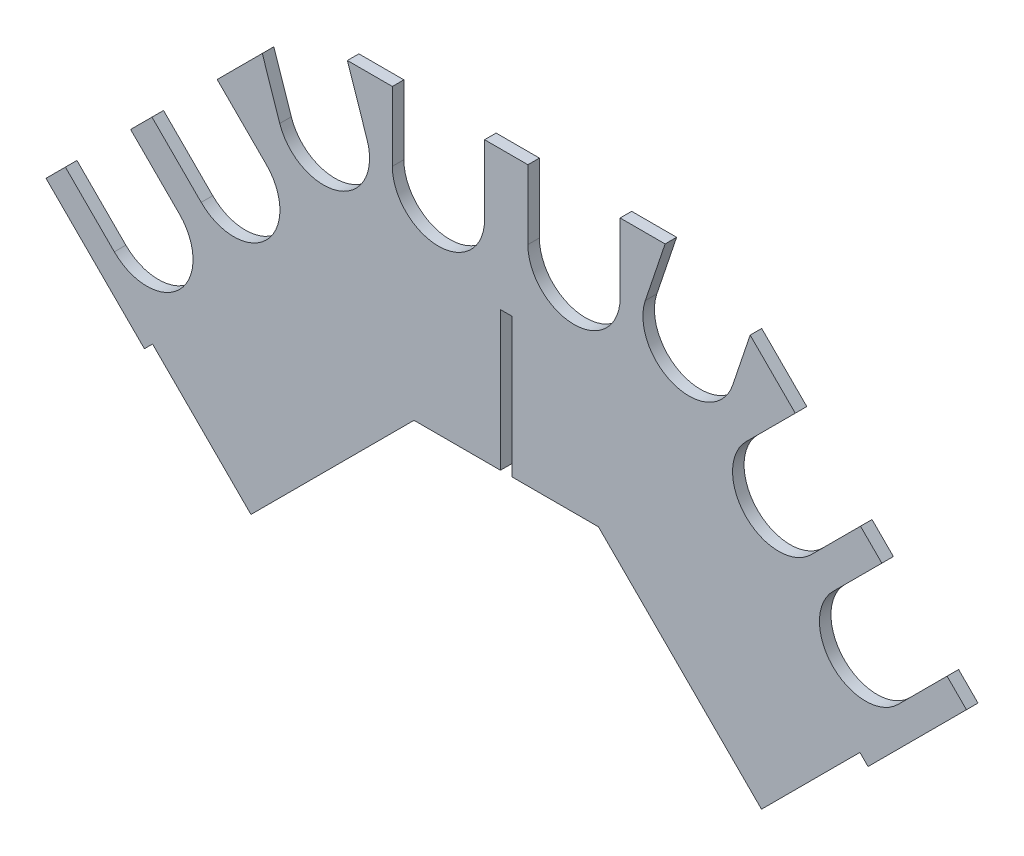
from build123d import *

# Parameters (mm, degrees)
SKETCH1_R          = 50.8
EXTRUDE1_DEPTH     = 12.7
CUT_EXTRUDE1_REACH = 936.887


with BuildPart() as part:
    # Sketch1 → Extrude1 (new body)
    with BuildSketch(Plane.XY):
        Polygon((506.987939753, 506.987939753), (228.6, 785.375879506), (-228.6, 785.375879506), (-506.987939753, 506.987939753), (-398.586659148, 398.586659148), (-389.606403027, 407.566915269), (-281.205122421, 299.165634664), (-101.6, 478.770757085), (-6.35, 478.770757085), (-6.35, 632.073318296), (6.35, 632.073318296), (6.35, 478.770757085), (101.6, 478.770757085), (281.205122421, 299.165634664), (389.606403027, 407.566915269), (398.586659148, 398.586659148), align=None)
        with Locations((395.824225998, 510.388580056)):
            Circle(SKETCH1_R, mode=Mode.SUBTRACT)
        with Locations((300.122945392, 605.451653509)):
            Circle(SKETCH1_R, mode=Mode.SUBTRACT)
        with Locations((-395.824225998, 510.388580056)):
            Circle(SKETCH1_R, mode=Mode.SUBTRACT)
        with Locations((-300.122945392, 605.451653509)):
            Circle(SKETCH1_R, mode=Mode.SUBTRACT)
        with Locations((-201.340128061, 704.23447084)):
            Circle(SKETCH1_R, mode=Mode.SUBTRACT)
        with Locations((-74.659231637, 709.175879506)):
            Circle(SKETCH1_R, mode=Mode.SUBTRACT)
        with Locations((74.659231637, 709.175879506)):
            Circle(SKETCH1_R, mode=Mode.SUBTRACT)
        with Locations((201.340128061, 704.23447084)):
            Circle(SKETCH1_R, mode=Mode.SUBTRACT)
    extrude(amount=EXTRUDE1_DEPTH)

    # Sketch2 → Cut-Extrude1 (cut, up to next)
    with BuildSketch(Plane.XY.offset(12.7), mode=Mode.PRIVATE) as cut_extrude1_sk1:
        with BuildLine():
            Line((249.495229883, 688.056517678), (268.713748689, 745.262130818))
            Line((268.713748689, 745.262130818), (228.6, 785.375879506))
            Line((228.6, 785.375879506), (175.009831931, 785.375879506))
            Line((175.009831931, 785.375879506), (153.185026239, 720.412424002))
            ThreePointArc((153.185026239, 720.412424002), (217.518081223, 752.389572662), (249.495229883, 688.056517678))
        make_face()
    cut_extrude1_tool1 = extrude(cut_extrude1_sk1.sketch, amount=-CUT_EXTRUDE1_REACH, mode=Mode.PRIVATE) & part.part
    # Sketch2 → Cut-Extrude1 (cut, up to next)
    with BuildSketch(Plane.XY.offset(12.7), mode=Mode.PRIVATE) as cut_extrude1_sk2:
        with BuildLine():
            Line((125.459231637, 785.375879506), (125.459231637, 709.175879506))
            ThreePointArc((125.459231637, 709.175879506), (74.659231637, 759.975879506), (23.859231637, 709.175879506))
            Line((23.859231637, 709.175879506), (23.859231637, 785.375879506))
            Line((23.859231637, 785.375879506), (125.459231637, 785.375879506))
        make_face()
    cut_extrude1_tool2 = extrude(cut_extrude1_sk2.sketch, amount=-CUT_EXTRUDE1_REACH, mode=Mode.PRIVATE) & part.part
    # Sketch2 → Cut-Extrude1 (cut, up to next)
    with BuildSketch(Plane.XY.offset(12.7), mode=Mode.PRIVATE) as cut_extrude1_sk3:
        with BuildLine():
            Line((-23.859231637, 785.375879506), (-23.859231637, 709.175879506))
            ThreePointArc((-23.859231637, 709.175879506), (-74.659231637, 759.975879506), (-125.459231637, 709.175879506))
            Line((-125.459231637, 709.175879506), (-125.459231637, 785.375879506))
            Line((-125.459231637, 785.375879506), (-23.859231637, 785.375879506))
        make_face()
    cut_extrude1_tool3 = extrude(cut_extrude1_sk3.sketch, amount=-CUT_EXTRUDE1_REACH, mode=Mode.PRIVATE) & part.part
    # Sketch2 → Cut-Extrude1 (cut, up to next)
    with BuildSketch(Plane.XY.offset(12.7), mode=Mode.PRIVATE) as cut_extrude1_sk4:
        with BuildLine():
            Line((-268.713748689, 745.262130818), (-249.495229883, 688.056517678))
            ThreePointArc((-249.495229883, 688.056517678), (-217.518081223, 752.389572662), (-153.185026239, 720.412424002))
            Line((-153.185026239, 720.412424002), (-175.009831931, 785.375879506))
            Line((-175.009831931, 785.375879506), (-228.6, 785.375879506))
            Line((-228.6, 785.375879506), (-268.713748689, 745.262130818))
        make_face()
    cut_extrude1_tool4 = extrude(cut_extrude1_sk4.sketch, amount=-CUT_EXTRUDE1_REACH, mode=Mode.PRIVATE) & part.part
    # Sketch2 → Cut-Extrude1 (cut, up to next)
    with BuildSketch(Plane.XY.offset(12.7), mode=Mode.PRIVATE) as cut_extrude1_sk5:
        with BuildLine():
            Line((-318.402561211, 695.573318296), (-264.201920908, 641.372677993))
            ThreePointArc((-264.201920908, 641.372677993), (-336.043969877, 641.372677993), (-336.043969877, 569.530629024))
            Line((-336.043969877, 569.530629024), (-390.244610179, 623.731269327))
            Line((-390.244610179, 623.731269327), (-318.402561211, 695.573318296))
        make_face()
    cut_extrude1_tool5 = extrude(cut_extrude1_sk5.sketch, amount=-CUT_EXTRUDE1_REACH, mode=Mode.PRIVATE) & part.part
    # Sketch2 → Cut-Extrude1 (cut, up to next)
    with BuildSketch(Plane.XY.offset(12.7), mode=Mode.PRIVATE) as cut_extrude1_sk6:
        with BuildLine():
            Line((-413.78473824, 600.191141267), (-359.903201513, 546.30960454))
            ThreePointArc((-359.903201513, 546.30960454), (-431.745250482, 546.30960454), (-431.745250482, 474.467555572))
            Line((-431.745250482, 474.467555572), (-485.626787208, 528.349092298))
            Line((-485.626787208, 528.349092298), (-413.78473824, 600.191141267))
        make_face()
    cut_extrude1_tool6 = extrude(cut_extrude1_sk6.sketch, amount=-CUT_EXTRUDE1_REACH, mode=Mode.PRIVATE) & part.part
    # Sketch2 → Cut-Extrude1 (cut, up to next)
    with BuildSketch(Plane.XY.offset(12.7), mode=Mode.PRIVATE) as cut_extrude1_sk7:
        with BuildLine():
            Line((318.402561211, 695.573318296), (264.201920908, 641.372677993))
            ThreePointArc((264.201920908, 641.372677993), (336.043969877, 641.372677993), (336.043969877, 569.530629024))
            Line((336.043969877, 569.530629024), (390.244610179, 623.731269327))
            Line((390.244610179, 623.731269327), (318.402561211, 695.573318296))
        make_face()
    cut_extrude1_tool7 = extrude(cut_extrude1_sk7.sketch, amount=-CUT_EXTRUDE1_REACH, mode=Mode.PRIVATE) & part.part
    # Sketch2 → Cut-Extrude1 (cut, up to next)
    with BuildSketch(Plane.XY.offset(12.7), mode=Mode.PRIVATE) as cut_extrude1_sk8:
        with BuildLine():
            Line((413.78473824, 600.191141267), (359.903201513, 546.30960454))
            ThreePointArc((359.903201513, 546.30960454), (431.745250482, 546.30960454), (431.745250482, 474.467555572))
            Line((431.745250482, 474.467555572), (485.626787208, 528.349092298))
            Line((485.626787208, 528.349092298), (413.78473824, 600.191141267))
        make_face()
    cut_extrude1_tool8 = extrude(cut_extrude1_sk8.sketch, amount=-CUT_EXTRUDE1_REACH, mode=Mode.PRIVATE) & part.part
    add(cut_extrude1_tool1.solids().sort_by_distance((217.379948, 758.173576, 12.7))[0], mode=Mode.SUBTRACT)
    add(cut_extrude1_tool2.solids().sort_by_distance((74.659232, 765.454306, 12.7))[0], mode=Mode.SUBTRACT)
    add(cut_extrude1_tool3.solids().sort_by_distance((-74.659232, 765.454306, 12.7))[0], mode=Mode.SUBTRACT)
    add(cut_extrude1_tool4.solids().sort_by_distance((-217.379948, 758.173576, 12.7))[0], mode=Mode.SUBTRACT)
    add(cut_extrude1_tool5.solids().sort_by_distance((-340.092728, 645.421436, 12.7))[0], mode=Mode.SUBTRACT)
    add(cut_extrude1_tool6.solids().sort_by_distance((-435.619083, 550.183437, 12.7))[0], mode=Mode.SUBTRACT)
    add(cut_extrude1_tool7.solids().sort_by_distance((340.092728, 645.421436, 12.7))[0], mode=Mode.SUBTRACT)
    add(cut_extrude1_tool8.solids().sort_by_distance((435.619083, 550.183437, 12.7))[0], mode=Mode.SUBTRACT)


solid = part.part
